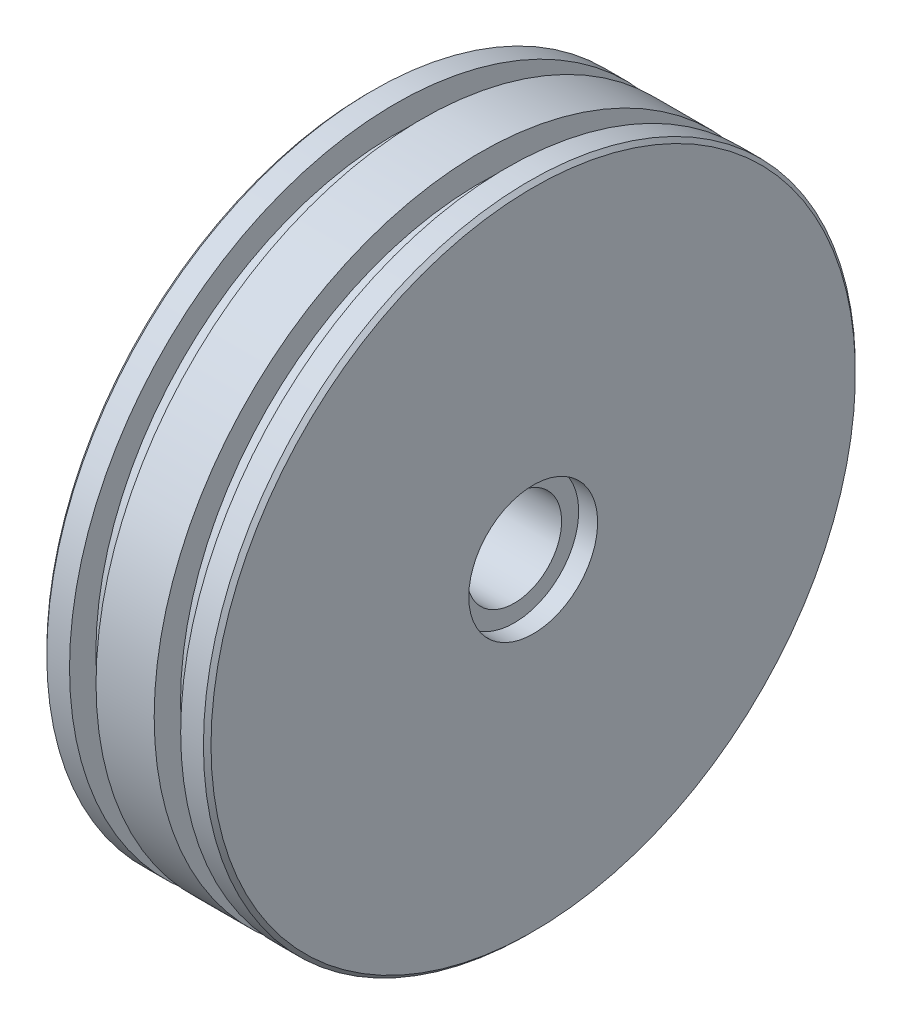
from build123d import *


with BuildPart() as part:
    # Esquisse1 → Base-R_volution (revolve)
    with BuildSketch(Plane.XY, mode=Mode.PRIVATE) as base_r_volution_sk:
        with BuildLine():
            Line((-46.01, 12.5), (-46.01, 22))
            Line((-46.01, 22), (-32.359017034, 22))
            ThreePointArc((-32.359017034, 22), (-31.240631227, 22.341924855), (-30.504649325, 23.250786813))
            Line((-30.504649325, 23.250786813), (-28.013147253, 29.417470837))
            ThreePointArc((-28.013147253, 29.417470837), (-28.026505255, 30.94814628), (-29.118301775, 32.021051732))
            Line((-29.118301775, 32.021051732), (-33.759213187, 33.896101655))
            ThreePointArc((-33.759213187, 33.896101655), (-34.668075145, 34.632083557), (-35.01, 35.750469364))
            Line((-35.01, 35.750469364), (-35.01, 37))
            ThreePointArc((-35.01, 37), (-34.131320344, 39.121320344), (-32.01, 40))
            Line((-32.01, 40), (-29.01, 40))
            ThreePointArc((-29.01, 40), (-26.888679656, 40.878679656), (-26.01, 43))
            Line((-26.01, 43), (-26.01, 70))
            ThreePointArc((-26.01, 70), (-26.888679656, 72.121320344), (-29.01, 73))
            Line((-29.01, 73), (-60.331469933, 73))
            ThreePointArc((-60.331469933, 73), (-62.452790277, 73.878679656), (-63.331469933, 76))
            Line((-63.331469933, 76), (-63.331469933, 85))
            Line((-63.331469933, 85), (-62.331469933, 86))
            Line((-62.331469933, 86), (-56.331469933, 86))
            Line((-56.331469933, 86), (-56.331469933, 79.05))
            Line((-56.331469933, 79.05), (-49.341469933, 79.05))
            Line((-49.341469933, 79.05), (-49.341469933, 86))
            Line((-49.341469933, 86), (-34, 86))
            Line((-34, 86), (-34, 79.05))
            Line((-34, 79.05), (-27.01, 79.05))
            Line((-27.01, 79.05), (-27.01, 86))
            Line((-27.01, 86), (-21.01, 86))
            Line((-21.01, 86), (-20.01, 85))
            Line((-20.01, 85), (-20.01, 17))
            Line((-20.01, 17), (-25.01, 17))
            Line((-25.01, 17), (-25.01, 12.5))
            Line((-25.01, 12.5), (-46.01, 12.5))
        make_face()
    revolve(base_r_volution_sk.sketch.rotate(Axis((-110, 0, 0), (1, 0, 0)), 90), axis=Axis((-110, 0, 0), (1, 0, 0)))


solid = part.part
